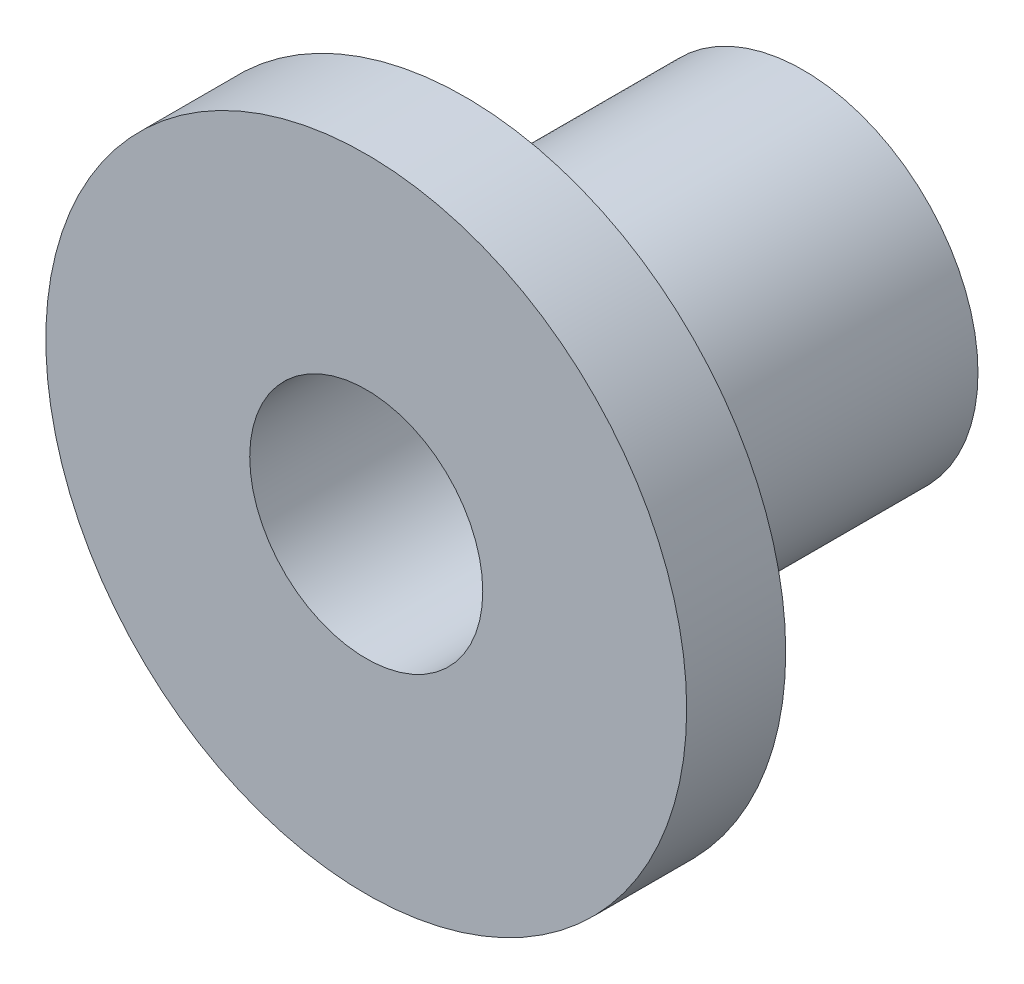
ISO-10303-21;
HEADER;
FILE_DESCRIPTION(('STEP AP214'),'2;1');
FILE_NAME('part.step','',(''),(''),'','','');
FILE_SCHEMA(('AUTOMOTIVE_DESIGN { 1 0 10303 214 1 1 1 1 }'));
ENDSEC;
DATA;
#1=APPLICATION_CONTEXT('core data for automotive mechanical design processes');
#2=APPLICATION_PROTOCOL_DEFINITION('international standard','automotive_design',2000,#1);
#3=PRODUCT_CONTEXT('',#1,'mechanical');
#4=PRODUCT('Part','Part','',(#3));
#5=PRODUCT_RELATED_PRODUCT_CATEGORY('part','',(#4));
#6=PRODUCT_DEFINITION_FORMATION('','',#4);
#7=PRODUCT_DEFINITION_CONTEXT('part definition',#1,'design');
#8=PRODUCT_DEFINITION('design','',#6,#7);
#9=PRODUCT_DEFINITION_SHAPE('','',#8);
#10=(LENGTH_UNIT() NAMED_UNIT(*) SI_UNIT(.MILLI.,.METRE.));
#11=(NAMED_UNIT(*) PLANE_ANGLE_UNIT() SI_UNIT($,.RADIAN.));
#12=(NAMED_UNIT(*) SI_UNIT($,.STERADIAN.) SOLID_ANGLE_UNIT());
#13=UNCERTAINTY_MEASURE_WITH_UNIT(LENGTH_MEASURE(1.E-05),#10,'distance_accuracy_value','');
#14=(GEOMETRIC_REPRESENTATION_CONTEXT(3) GLOBAL_UNCERTAINTY_ASSIGNED_CONTEXT((#13)) GLOBAL_UNIT_ASSIGNED_CONTEXT((#10,
#11,#12)) REPRESENTATION_CONTEXT('',''));
#15=CARTESIAN_POINT('',(0.,0.,0.));
#16=DIRECTION('',(0.,0.,1.));
#17=DIRECTION('',(1.,0.,0.));
#18=AXIS2_PLACEMENT_3D('',#15,#16,#17);
#19=CARTESIAN_POINT('',(0.,0.,15.));
#20=DIRECTION('',(0.,0.,-1.));
#21=DIRECTION('',(-1.,0.,0.));
#22=AXIS2_PLACEMENT_3D('',#19,#20,#21);
#23=CYLINDRICAL_SURFACE('',#22,6.);
#24=CARTESIAN_POINT('',(0.,0.,0.));
#25=DIRECTION('',(0.,0.,1.));
#26=DIRECTION('',(1.,0.,0.));
#27=AXIS2_PLACEMENT_3D('',#24,#25,#26);
#28=CIRCLE('',#27,6.);
#29=CARTESIAN_POINT('',(6.,0.,0.));
#30=VERTEX_POINT('',#29);
#31=EDGE_CURVE('E44',#30,#30,#28,.T.);
#32=ORIENTED_EDGE('',*,*,#31,.T.);
#33=EDGE_LOOP('',(#32));
#34=FACE_BOUND('',#33,.T.);
#35=CARTESIAN_POINT('',(0.,0.,11.6));
#36=DIRECTION('',(0.,0.,1.));
#37=DIRECTION('',(1.,0.,0.));
#38=AXIS2_PLACEMENT_3D('',#35,#36,#37);
#39=CIRCLE('',#38,6.);
#40=CARTESIAN_POINT('',(6.,0.,11.6));
#41=VERTEX_POINT('',#40);
#42=EDGE_CURVE('E10',#41,#41,#39,.T.);
#43=ORIENTED_EDGE('',*,*,#42,.F.);
#44=EDGE_LOOP('',(#43));
#45=FACE_BOUND('',#44,.T.);
#46=ADVANCED_FACE('F41',(#34,#45),#23,.T.);
#47=CARTESIAN_POINT('',(0.,0.,15.));
#48=DIRECTION('',(0.,0.,1.));
#49=DIRECTION('',(1.,0.,0.));
#50=AXIS2_PLACEMENT_3D('',#47,#48,#49);
#51=PLANE('',#50);
#52=CARTESIAN_POINT('',(0.,0.,15.));
#53=DIRECTION('',(0.,0.,1.));
#54=DIRECTION('',(1.,0.,0.));
#55=AXIS2_PLACEMENT_3D('',#52,#53,#54);
#56=CIRCLE('',#55,4.);
#57=CARTESIAN_POINT('',(4.,0.,15.));
#58=VERTEX_POINT('',#57);
#59=EDGE_CURVE('E54',#58,#58,#56,.T.);
#60=ORIENTED_EDGE('',*,*,#59,.F.);
#61=EDGE_LOOP('',(#60));
#62=FACE_BOUND('',#61,.T.);
#63=CARTESIAN_POINT('',(0.,0.,15.));
#64=DIRECTION('',(0.,0.,1.));
#65=DIRECTION('',(1.,0.,0.));
#66=AXIS2_PLACEMENT_3D('',#63,#64,#65);
#67=CIRCLE('',#66,11.);
#68=CARTESIAN_POINT('',(11.,0.,15.));
#69=VERTEX_POINT('',#68);
#70=EDGE_CURVE('E57',#69,#69,#67,.T.);
#71=ORIENTED_EDGE('',*,*,#70,.T.);
#72=EDGE_LOOP('',(#71));
#73=FACE_BOUND('',#72,.T.);
#74=ADVANCED_FACE('F75',(#62,#73),#51,.T.);
#75=CARTESIAN_POINT('',(0.,0.,0.));
#76=DIRECTION('',(0.,0.,1.));
#77=DIRECTION('',(1.,0.,0.));
#78=AXIS2_PLACEMENT_3D('',#75,#76,#77);
#79=PLANE('',#78);
#80=ORIENTED_EDGE('',*,*,#31,.F.);
#81=EDGE_LOOP('',(#80));
#82=FACE_BOUND('',#81,.T.);
#83=CARTESIAN_POINT('',(0.,0.,0.));
#84=DIRECTION('',(0.,0.,1.));
#85=DIRECTION('',(1.,0.,0.));
#86=AXIS2_PLACEMENT_3D('',#83,#84,#85);
#87=CIRCLE('',#86,4.);
#88=CARTESIAN_POINT('',(4.,0.,0.));
#89=VERTEX_POINT('',#88);
#90=EDGE_CURVE('E61',#89,#89,#87,.T.);
#91=ORIENTED_EDGE('',*,*,#90,.T.);
#92=EDGE_LOOP('',(#91));
#93=FACE_BOUND('',#92,.T.);
#94=ADVANCED_FACE('F93',(#82,#93),#79,.F.);
#95=CARTESIAN_POINT('',(0.,0.,15.));
#96=DIRECTION('',(0.,0.,-1.));
#97=DIRECTION('',(-1.,0.,0.));
#98=AXIS2_PLACEMENT_3D('',#95,#96,#97);
#99=CYLINDRICAL_SURFACE('',#98,4.);
#100=ORIENTED_EDGE('',*,*,#59,.T.);
#101=EDGE_LOOP('',(#100));
#102=FACE_BOUND('',#101,.T.);
#103=ORIENTED_EDGE('',*,*,#90,.F.);
#104=EDGE_LOOP('',(#103));
#105=FACE_BOUND('',#104,.T.);
#106=ADVANCED_FACE('F84',(#102,#105),#99,.F.);
#107=CARTESIAN_POINT('',(0.,0.,11.6));
#108=DIRECTION('',(0.,0.,1.));
#109=DIRECTION('',(1.,0.,0.));
#110=AXIS2_PLACEMENT_3D('',#107,#108,#109);
#111=PLANE('',#110);
#112=CARTESIAN_POINT('',(0.,0.,11.6));
#113=DIRECTION('',(0.,0.,1.));
#114=DIRECTION('',(1.,0.,0.));
#115=AXIS2_PLACEMENT_3D('',#112,#113,#114);
#116=CIRCLE('',#115,11.);
#117=CARTESIAN_POINT('',(11.,0.,11.6));
#118=VERTEX_POINT('',#117);
#119=EDGE_CURVE('E64',#118,#118,#116,.T.);
#120=ORIENTED_EDGE('',*,*,#119,.F.);
#121=EDGE_LOOP('',(#120));
#122=FACE_BOUND('',#121,.T.);
#123=ORIENTED_EDGE('',*,*,#42,.T.);
#124=EDGE_LOOP('',(#123));
#125=FACE_BOUND('',#124,.T.);
#126=ADVANCED_FACE('F79',(#122,#125),#111,.F.);
#127=CARTESIAN_POINT('',(0.,0.,11.6));
#128=DIRECTION('',(0.,0.,1.));
#129=DIRECTION('',(1.,0.,0.));
#130=AXIS2_PLACEMENT_3D('',#127,#128,#129);
#131=CYLINDRICAL_SURFACE('',#130,11.);
#132=ORIENTED_EDGE('',*,*,#119,.T.);
#133=EDGE_LOOP('',(#132));
#134=FACE_BOUND('',#133,.T.);
#135=ORIENTED_EDGE('',*,*,#70,.F.);
#136=EDGE_LOOP('',(#135));
#137=FACE_BOUND('',#136,.T.);
#138=ADVANCED_FACE('F77',(#134,#137),#131,.T.);
#139=CLOSED_SHELL('',(#46,#74,#94,#106,#126,#138));
#140=MANIFOLD_SOLID_BREP('B2',#139);
#141=ADVANCED_BREP_SHAPE_REPRESENTATION('',(#18,#140),#14);
#142=SHAPE_DEFINITION_REPRESENTATION(#9,#141);
ENDSEC;
END-ISO-10303-21;
